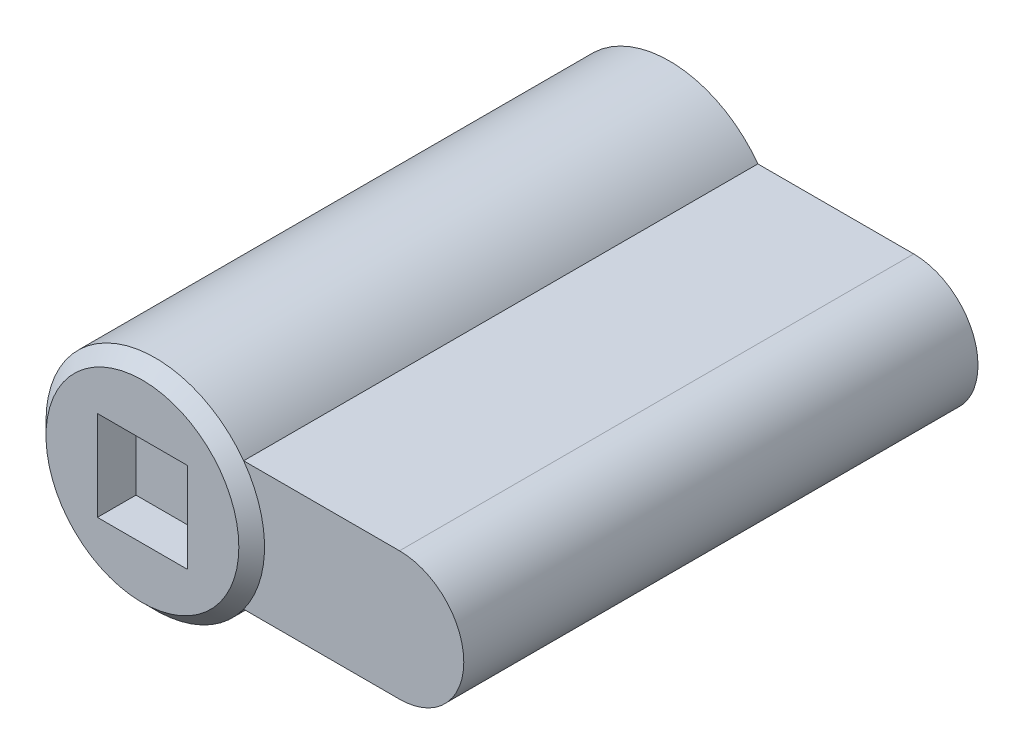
ISO-10303-21;
HEADER;
FILE_DESCRIPTION(('STEP AP214'),'2;1');
FILE_NAME('part.step','',(''),(''),'','','');
FILE_SCHEMA(('AUTOMOTIVE_DESIGN { 1 0 10303 214 1 1 1 1 }'));
ENDSEC;
DATA;
#1=APPLICATION_CONTEXT('core data for automotive mechanical design processes');
#2=APPLICATION_PROTOCOL_DEFINITION('international standard','automotive_design',2000,#1);
#3=PRODUCT_CONTEXT('',#1,'mechanical');
#4=PRODUCT('Part','Part','',(#3));
#5=PRODUCT_RELATED_PRODUCT_CATEGORY('part','',(#4));
#6=PRODUCT_DEFINITION_FORMATION('','',#4);
#7=PRODUCT_DEFINITION_CONTEXT('part definition',#1,'design');
#8=PRODUCT_DEFINITION('design','',#6,#7);
#9=PRODUCT_DEFINITION_SHAPE('','',#8);
#10=(LENGTH_UNIT() NAMED_UNIT(*) SI_UNIT(.MILLI.,.METRE.));
#11=(NAMED_UNIT(*) PLANE_ANGLE_UNIT() SI_UNIT($,.RADIAN.));
#12=(NAMED_UNIT(*) SI_UNIT($,.STERADIAN.) SOLID_ANGLE_UNIT());
#13=UNCERTAINTY_MEASURE_WITH_UNIT(LENGTH_MEASURE(1.E-05),#10,'distance_accuracy_value','');
#14=(GEOMETRIC_REPRESENTATION_CONTEXT(3) GLOBAL_UNCERTAINTY_ASSIGNED_CONTEXT((#13)) GLOBAL_UNIT_ASSIGNED_CONTEXT((#10,
#11,#12)) REPRESENTATION_CONTEXT('',''));
#15=CARTESIAN_POINT('',(0.,0.,0.));
#16=DIRECTION('',(0.,0.,1.));
#17=DIRECTION('',(1.,0.,0.));
#18=AXIS2_PLACEMENT_3D('',#15,#16,#17);
#19=CARTESIAN_POINT('',(0.,0.,-40.));
#20=DIRECTION('',(0.,0.,1.));
#21=DIRECTION('',(0.,1.,0.));
#22=AXIS2_PLACEMENT_3D('',#19,#20,#21);
#23=CYLINDRICAL_SURFACE('',#22,8.5);
#24=DIRECTION('',(0.,0.,1.));
#25=VECTOR('',#24,1.);
#26=CARTESIAN_POINT('',(6.87386354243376,-5.,-40.));
#27=LINE('',#26,#25);
#28=CARTESIAN_POINT('',(6.87386354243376,-5.,-40.));
#29=VERTEX_POINT('',#28);
#30=CARTESIAN_POINT('',(6.87386354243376,-5.,0.));
#31=VERTEX_POINT('',#30);
#32=EDGE_CURVE('E136',#29,#31,#27,.T.);
#33=ORIENTED_EDGE('',*,*,#32,.T.);
#34=CARTESIAN_POINT('',(0.,0.,0.));
#35=DIRECTION('',(0.,0.,1.));
#36=DIRECTION('',(0.,1.,0.));
#37=AXIS2_PLACEMENT_3D('',#34,#35,#36);
#38=CIRCLE('',#37,8.5);
#39=CARTESIAN_POINT('',(6.87386354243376,5.,0.));
#40=VERTEX_POINT('',#39);
#41=EDGE_CURVE('E9',#31,#40,#38,.F.);
#42=ORIENTED_EDGE('',*,*,#41,.T.);
#43=DIRECTION('',(0.,0.,1.));
#44=VECTOR('',#43,1.);
#45=CARTESIAN_POINT('',(6.87386354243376,5.,-40.));
#46=LINE('',#45,#44);
#47=CARTESIAN_POINT('',(6.87386354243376,5.,-40.));
#48=VERTEX_POINT('',#47);
#49=EDGE_CURVE('E36',#48,#40,#46,.T.);
#50=ORIENTED_EDGE('',*,*,#49,.F.);
#51=CARTESIAN_POINT('',(0.,0.,-40.));
#52=DIRECTION('',(0.,0.,1.));
#53=DIRECTION('',(0.,1.,0.));
#54=AXIS2_PLACEMENT_3D('',#51,#52,#53);
#55=CIRCLE('',#54,8.5);
#56=EDGE_CURVE('E125',#48,#29,#55,.T.);
#57=ORIENTED_EDGE('',*,*,#56,.T.);
#58=EDGE_LOOP('',(#33,#42,#50,#57));
#59=FACE_BOUND('',#58,.T.);
#60=ADVANCED_FACE('F14',(#59),#23,.T.);
#61=CARTESIAN_POINT('',(6.87386354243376,5.,-40.));
#62=DIRECTION('',(0.,-1.,0.));
#63=DIRECTION('',(1.,0.,0.));
#64=AXIS2_PLACEMENT_3D('',#61,#62,#63);
#65=PLANE('',#64);
#66=DIRECTION('',(0.,0.,1.));
#67=VECTOR('',#66,1.);
#68=CARTESIAN_POINT('',(19.,5.,-40.));
#69=LINE('',#68,#67);
#70=CARTESIAN_POINT('',(19.,5.,-40.));
#71=VERTEX_POINT('',#70);
#72=CARTESIAN_POINT('',(19.,5.,0.));
#73=VERTEX_POINT('',#72);
#74=EDGE_CURVE('E139',#71,#73,#69,.T.);
#75=ORIENTED_EDGE('',*,*,#74,.F.);
#76=DIRECTION('',(1.,0.,0.));
#77=VECTOR('',#76,1.);
#78=CARTESIAN_POINT('',(6.87386354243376,5.,-40.));
#79=LINE('',#78,#77);
#80=EDGE_CURVE('E133',#48,#71,#79,.T.);
#81=ORIENTED_EDGE('',*,*,#80,.F.);
#82=ORIENTED_EDGE('',*,*,#49,.T.);
#83=DIRECTION('',(1.,0.,0.));
#84=VECTOR('',#83,1.);
#85=CARTESIAN_POINT('',(6.87386354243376,5.,0.));
#86=LINE('',#85,#84);
#87=EDGE_CURVE('E123',#40,#73,#86,.T.);
#88=ORIENTED_EDGE('',*,*,#87,.T.);
#89=EDGE_LOOP('',(#75,#81,#82,#88));
#90=FACE_BOUND('',#89,.T.);
#91=ADVANCED_FACE('F16',(#90),#65,.F.);
#92=CARTESIAN_POINT('',(19.,0.,-40.));
#93=DIRECTION('',(0.,0.,1.));
#94=DIRECTION('',(0.,1.,0.));
#95=AXIS2_PLACEMENT_3D('',#92,#93,#94);
#96=CYLINDRICAL_SURFACE('',#95,5.);
#97=DIRECTION('',(0.,0.,1.));
#98=VECTOR('',#97,1.);
#99=CARTESIAN_POINT('',(19.,-5.,-40.));
#100=LINE('',#99,#98);
#101=CARTESIAN_POINT('',(19.,-5.,-40.));
#102=VERTEX_POINT('',#101);
#103=CARTESIAN_POINT('',(19.,-5.,0.));
#104=VERTEX_POINT('',#103);
#105=EDGE_CURVE('E137',#102,#104,#100,.T.);
#106=ORIENTED_EDGE('',*,*,#105,.F.);
#107=CARTESIAN_POINT('',(19.,0.,-40.));
#108=DIRECTION('',(0.,0.,1.));
#109=DIRECTION('',(0.,1.,0.));
#110=AXIS2_PLACEMENT_3D('',#107,#108,#109);
#111=CIRCLE('',#110,5.);
#112=EDGE_CURVE('E130',#102,#71,#111,.T.);
#113=ORIENTED_EDGE('',*,*,#112,.T.);
#114=ORIENTED_EDGE('',*,*,#74,.T.);
#115=CARTESIAN_POINT('',(19.,0.,0.));
#116=DIRECTION('',(0.,0.,1.));
#117=DIRECTION('',(0.,1.,0.));
#118=AXIS2_PLACEMENT_3D('',#115,#116,#117);
#119=CIRCLE('',#118,5.);
#120=EDGE_CURVE('E120',#104,#73,#119,.T.);
#121=ORIENTED_EDGE('',*,*,#120,.F.);
#122=EDGE_LOOP('',(#106,#113,#114,#121));
#123=FACE_BOUND('',#122,.T.);
#124=ADVANCED_FACE('F172',(#123),#96,.T.);
#125=CARTESIAN_POINT('',(6.87386354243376,-5.,-40.));
#126=DIRECTION('',(0.,-1.,0.));
#127=DIRECTION('',(1.,0.,0.));
#128=AXIS2_PLACEMENT_3D('',#125,#126,#127);
#129=PLANE('',#128);
#130=DIRECTION('',(1.,0.,0.));
#131=VECTOR('',#130,1.);
#132=CARTESIAN_POINT('',(6.87386354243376,-5.,-40.));
#133=LINE('',#132,#131);
#134=EDGE_CURVE('E127',#29,#102,#133,.T.);
#135=ORIENTED_EDGE('',*,*,#134,.T.);
#136=ORIENTED_EDGE('',*,*,#105,.T.);
#137=DIRECTION('',(1.,0.,0.));
#138=VECTOR('',#137,1.);
#139=CARTESIAN_POINT('',(6.87386354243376,-5.,0.));
#140=LINE('',#139,#138);
#141=EDGE_CURVE('E124',#31,#104,#140,.T.);
#142=ORIENTED_EDGE('',*,*,#141,.F.);
#143=ORIENTED_EDGE('',*,*,#32,.F.);
#144=EDGE_LOOP('',(#135,#136,#142,#143));
#145=FACE_BOUND('',#144,.T.);
#146=ADVANCED_FACE('F178',(#145),#129,.T.);
#147=CARTESIAN_POINT('',(0.,0.,-40.));
#148=DIRECTION('',(0.,0.,1.));
#149=DIRECTION('',(0.,1.,0.));
#150=AXIS2_PLACEMENT_3D('',#147,#148,#149);
#151=PLANE('',#150);
#152=ORIENTED_EDGE('',*,*,#56,.F.);
#153=ORIENTED_EDGE('',*,*,#80,.T.);
#154=ORIENTED_EDGE('',*,*,#112,.F.);
#155=ORIENTED_EDGE('',*,*,#134,.F.);
#156=EDGE_LOOP('',(#152,#153,#154,#155));
#157=FACE_BOUND('',#156,.T.);
#158=ADVANCED_FACE('F176',(#157),#151,.F.);
#159=CARTESIAN_POINT('',(0.,0.,0.));
#160=DIRECTION('',(0.,0.,1.));
#161=DIRECTION('',(0.,1.,0.));
#162=AXIS2_PLACEMENT_3D('',#159,#160,#161);
#163=PLANE('',#162);
#164=CARTESIAN_POINT('',(0.,0.,0.));
#165=DIRECTION('',(0.,0.,1.));
#166=DIRECTION('',(0.,1.,0.));
#167=AXIS2_PLACEMENT_3D('',#164,#165,#166);
#168=CIRCLE('',#167,8.5);
#169=EDGE_CURVE('E119',#31,#40,#168,.T.);
#170=ORIENTED_EDGE('',*,*,#169,.F.);
#171=ORIENTED_EDGE('',*,*,#141,.T.);
#172=ORIENTED_EDGE('',*,*,#120,.T.);
#173=ORIENTED_EDGE('',*,*,#87,.F.);
#174=EDGE_LOOP('',(#170,#171,#172,#173));
#175=FACE_BOUND('',#174,.T.);
#176=ADVANCED_FACE('F164',(#175),#163,.T.);
#177=CARTESIAN_POINT('',(0.,0.,1.));
#178=DIRECTION('',(0.,0.,1.));
#179=DIRECTION('',(0.,1.,0.));
#180=AXIS2_PLACEMENT_3D('',#177,#178,#179);
#181=PLANE('',#180);
#182=DIRECTION('',(1.,0.,0.));
#183=VECTOR('',#182,1.);
#184=CARTESIAN_POINT('',(-3.5,-3.5,1.));
#185=LINE('',#184,#183);
#186=CARTESIAN_POINT('',(-3.5,-3.5,1.));
#187=VERTEX_POINT('',#186);
#188=CARTESIAN_POINT('',(3.5,-3.5,1.));
#189=VERTEX_POINT('',#188);
#190=EDGE_CURVE('E29',#187,#189,#185,.T.);
#191=ORIENTED_EDGE('',*,*,#190,.F.);
#192=DIRECTION('',(0.,1.,0.));
#193=VECTOR('',#192,1.);
#194=CARTESIAN_POINT('',(-3.5,-3.5,1.));
#195=LINE('',#194,#193);
#196=CARTESIAN_POINT('',(-3.5,3.5,1.));
#197=VERTEX_POINT('',#196);
#198=EDGE_CURVE('E101',#187,#197,#195,.T.);
#199=ORIENTED_EDGE('',*,*,#198,.T.);
#200=DIRECTION('',(-1.,0.,0.));
#201=VECTOR('',#200,1.);
#202=CARTESIAN_POINT('',(3.5,3.5,1.));
#203=LINE('',#202,#201);
#204=CARTESIAN_POINT('',(3.5,3.5,1.));
#205=VERTEX_POINT('',#204);
#206=EDGE_CURVE('E83',#205,#197,#203,.T.);
#207=ORIENTED_EDGE('',*,*,#206,.F.);
#208=DIRECTION('',(0.,-1.,0.));
#209=VECTOR('',#208,1.);
#210=CARTESIAN_POINT('',(3.5,3.5,1.));
#211=LINE('',#210,#209);
#212=EDGE_CURVE('E94',#205,#189,#211,.T.);
#213=ORIENTED_EDGE('',*,*,#212,.T.);
#214=EDGE_LOOP('',(#191,#199,#207,#213));
#215=FACE_BOUND('',#214,.T.);
#216=CARTESIAN_POINT('',(0.,0.,1.));
#217=DIRECTION('',(0.,0.,1.));
#218=DIRECTION('',(0.,1.,0.));
#219=AXIS2_PLACEMENT_3D('',#216,#217,#218);
#220=CIRCLE('',#219,7.5);
#221=CARTESIAN_POINT('',(0.,7.5,1.));
#222=VERTEX_POINT('',#221);
#223=EDGE_CURVE('E22',#222,#222,#220,.T.);
#224=ORIENTED_EDGE('',*,*,#223,.T.);
#225=EDGE_LOOP('',(#224));
#226=FACE_BOUND('',#225,.T.);
#227=ADVANCED_FACE('F98',(#215,#226),#181,.T.);
#228=CARTESIAN_POINT('',(0.,0.,1.));
#229=DIRECTION('',(0.,0.,-1.));
#230=DIRECTION('',(0.,-1.,0.));
#231=AXIS2_PLACEMENT_3D('',#228,#229,#230);
#232=CONICAL_SURFACE('',#231,7.5,0.785398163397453);
#233=ORIENTED_EDGE('',*,*,#41,.F.);
#234=ORIENTED_EDGE('',*,*,#169,.T.);
#235=EDGE_LOOP('',(#233,#234));
#236=FACE_BOUND('',#235,.T.);
#237=ORIENTED_EDGE('',*,*,#223,.F.);
#238=EDGE_LOOP('',(#237));
#239=FACE_BOUND('',#238,.T.);
#240=ADVANCED_FACE('F152',(#236,#239),#232,.T.);
#241=CARTESIAN_POINT('',(-3.5,-3.5,-2.));
#242=DIRECTION('',(0.,-1.,0.));
#243=DIRECTION('',(1.,0.,0.));
#244=AXIS2_PLACEMENT_3D('',#241,#242,#243);
#245=PLANE('',#244);
#246=DIRECTION('',(0.,0.,1.));
#247=VECTOR('',#246,1.);
#248=CARTESIAN_POINT('',(-3.5,-3.5,-2.));
#249=LINE('',#248,#247);
#250=CARTESIAN_POINT('',(-3.5,-3.5,-2.));
#251=VERTEX_POINT('',#250);
#252=EDGE_CURVE('E117',#251,#187,#249,.T.);
#253=ORIENTED_EDGE('',*,*,#252,.T.);
#254=ORIENTED_EDGE('',*,*,#190,.T.);
#255=DIRECTION('',(0.,0.,1.));
#256=VECTOR('',#255,1.);
#257=CARTESIAN_POINT('',(3.5,-3.5,-2.));
#258=LINE('',#257,#256);
#259=CARTESIAN_POINT('',(3.5,-3.5,-2.));
#260=VERTEX_POINT('',#259);
#261=EDGE_CURVE('E91',#260,#189,#258,.T.);
#262=ORIENTED_EDGE('',*,*,#261,.F.);
#263=DIRECTION('',(1.,0.,0.));
#264=VECTOR('',#263,1.);
#265=CARTESIAN_POINT('',(-3.5,-3.5,-2.));
#266=LINE('',#265,#264);
#267=EDGE_CURVE('E103',#251,#260,#266,.T.);
#268=ORIENTED_EDGE('',*,*,#267,.F.);
#269=EDGE_LOOP('',(#253,#254,#262,#268));
#270=FACE_BOUND('',#269,.T.);
#271=ADVANCED_FACE('F154',(#270),#245,.F.);
#272=CARTESIAN_POINT('',(-3.5,-3.5,-2.));
#273=DIRECTION('',(1.,0.,0.));
#274=DIRECTION('',(0.,0.,-1.));
#275=AXIS2_PLACEMENT_3D('',#272,#273,#274);
#276=PLANE('',#275);
#277=DIRECTION('',(0.,0.,1.));
#278=VECTOR('',#277,1.);
#279=CARTESIAN_POINT('',(-3.5,3.5,-2.));
#280=LINE('',#279,#278);
#281=CARTESIAN_POINT('',(-3.5,3.5,-2.));
#282=VERTEX_POINT('',#281);
#283=EDGE_CURVE('E90',#282,#197,#280,.T.);
#284=ORIENTED_EDGE('',*,*,#283,.T.);
#285=ORIENTED_EDGE('',*,*,#198,.F.);
#286=ORIENTED_EDGE('',*,*,#252,.F.);
#287=DIRECTION('',(0.,1.,0.));
#288=VECTOR('',#287,1.);
#289=CARTESIAN_POINT('',(-3.5,-3.5,-2.));
#290=LINE('',#289,#288);
#291=EDGE_CURVE('E112',#251,#282,#290,.T.);
#292=ORIENTED_EDGE('',*,*,#291,.T.);
#293=EDGE_LOOP('',(#284,#285,#286,#292));
#294=FACE_BOUND('',#293,.T.);
#295=ADVANCED_FACE('F162',(#294),#276,.T.);
#296=CARTESIAN_POINT('',(3.5,3.5,-2.));
#297=DIRECTION('',(0.,1.,0.));
#298=DIRECTION('',(0.,0.,-1.));
#299=AXIS2_PLACEMENT_3D('',#296,#297,#298);
#300=PLANE('',#299);
#301=DIRECTION('',(0.,0.,1.));
#302=VECTOR('',#301,1.);
#303=CARTESIAN_POINT('',(3.5,3.5,-2.));
#304=LINE('',#303,#302);
#305=CARTESIAN_POINT('',(3.5,3.5,-2.));
#306=VERTEX_POINT('',#305);
#307=EDGE_CURVE('E79',#306,#205,#304,.T.);
#308=ORIENTED_EDGE('',*,*,#307,.T.);
#309=ORIENTED_EDGE('',*,*,#206,.T.);
#310=ORIENTED_EDGE('',*,*,#283,.F.);
#311=DIRECTION('',(-1.,0.,0.));
#312=VECTOR('',#311,1.);
#313=CARTESIAN_POINT('',(3.5,3.5,-2.));
#314=LINE('',#313,#312);
#315=EDGE_CURVE('E86',#306,#282,#314,.T.);
#316=ORIENTED_EDGE('',*,*,#315,.F.);
#317=EDGE_LOOP('',(#308,#309,#310,#316));
#318=FACE_BOUND('',#317,.T.);
#319=ADVANCED_FACE('F81',(#318),#300,.F.);
#320=CARTESIAN_POINT('',(3.5,3.5,-2.));
#321=DIRECTION('',(-1.,0.,0.));
#322=DIRECTION('',(0.,0.,1.));
#323=AXIS2_PLACEMENT_3D('',#320,#321,#322);
#324=PLANE('',#323);
#325=DIRECTION('',(0.,-1.,0.));
#326=VECTOR('',#325,1.);
#327=CARTESIAN_POINT('',(3.5,3.5,-2.));
#328=LINE('',#327,#326);
#329=EDGE_CURVE('E109',#306,#260,#328,.T.);
#330=ORIENTED_EDGE('',*,*,#329,.T.);
#331=ORIENTED_EDGE('',*,*,#261,.T.);
#332=ORIENTED_EDGE('',*,*,#212,.F.);
#333=ORIENTED_EDGE('',*,*,#307,.F.);
#334=EDGE_LOOP('',(#330,#331,#332,#333));
#335=FACE_BOUND('',#334,.T.);
#336=ADVANCED_FACE('F95',(#335),#324,.T.);
#337=CARTESIAN_POINT('',(3.5,-3.5,-2.));
#338=DIRECTION('',(0.,0.,-1.));
#339=DIRECTION('',(0.,-1.,0.));
#340=AXIS2_PLACEMENT_3D('',#337,#338,#339);
#341=PLANE('',#340);
#342=ORIENTED_EDGE('',*,*,#267,.T.);
#343=ORIENTED_EDGE('',*,*,#329,.F.);
#344=ORIENTED_EDGE('',*,*,#315,.T.);
#345=ORIENTED_EDGE('',*,*,#291,.F.);
#346=EDGE_LOOP('',(#342,#343,#344,#345));
#347=FACE_BOUND('',#346,.T.);
#348=ADVANCED_FACE('F240',(#347),#341,.F.);
#349=CLOSED_SHELL('',(#60,#91,#124,#146,#158,#176,#227,#240,#271,#295,#319,#336,#348));
#350=MANIFOLD_SOLID_BREP('B1',#349);
#351=ADVANCED_BREP_SHAPE_REPRESENTATION('',(#18,#350),#14);
#352=SHAPE_DEFINITION_REPRESENTATION(#9,#351);
ENDSEC;
END-ISO-10303-21;
